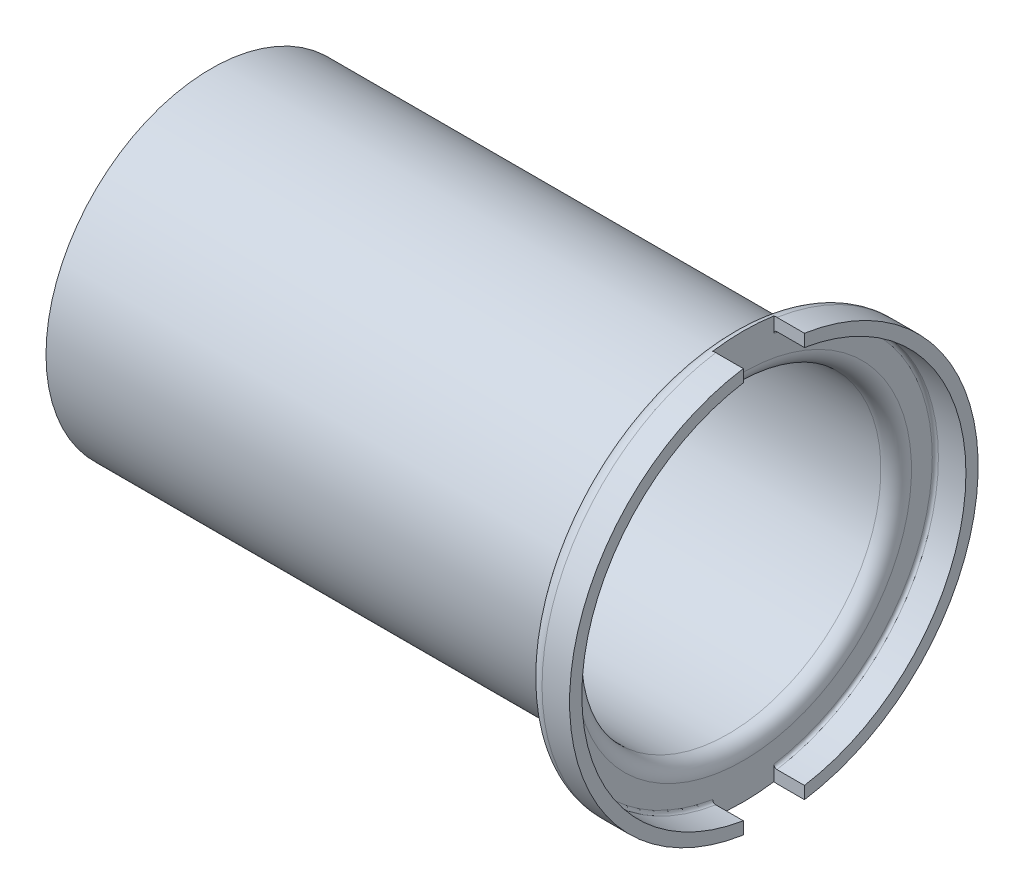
from build123d import *

# Parameters (mm, degrees)
ENL_V_MAT_EXTRU_1_DEPTH      = 104.417213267
ENL_V_MAT_EXTRU_1_DEPTH_BACK = 104.417213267
ESQUISSE2_W                  = 5
ESQUISSE2_H                  = 10


with BuildPart() as part:
    # Esquisse1 → Base-R_vol.-Mince (revolve)
    with BuildSketch(Plane.XY, mode=Mode.PRIVATE) as base_r_vol_mince_sk:
        with BuildLine():
            Line((0, 27), (84.5, 27))
            ThreePointArc((84.5, 27), (84.853553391, 27.146446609), (85, 27.5))
            Line((85, 27.5), (85, 30.9))
            ThreePointArc((85, 30.9), (85.732233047, 32.667766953), (87.5, 33.4))
            Line((87.5, 33.4), (92, 33.4))
            Line((92, 33.4), (92, 31.4))
            Line((92, 31.4), (87.5, 31.4))
            ThreePointArc((87.5, 31.4), (87.146446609, 31.253553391), (87, 30.9))
            Line((87, 30.9), (87, 27.5))
            ThreePointArc((87, 27.5), (86.267766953, 25.732233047), (84.5, 25))
            Line((84.5, 25), (0, 25))
            Line((0, 25), (0, 27))
        make_face()
    revolve(base_r_vol_mince_sk.sketch.rotate(Axis((0, 0, 0), (1, 0, 0)), 90), axis=Axis((0, 0, 0), (1, 0, 0)))

    # Esquisse2 → Enl_v. mat.-Extru.1 (cut, two sides: drawn at the far end of the back side and taken through both)
    with BuildSketch(Plane(origin=(0, 0, 0), x_dir=(1, 0, 0), z_dir=(0, 1, 0)).offset(-ENL_V_MAT_EXTRU_1_DEPTH_BACK)):
        with Locations((89.5, 0)):
            Rectangle(ESQUISSE2_W, ESQUISSE2_H)
    extrude(amount=ENL_V_MAT_EXTRU_1_DEPTH + ENL_V_MAT_EXTRU_1_DEPTH_BACK, mode=Mode.SUBTRACT)


solid = part.part
